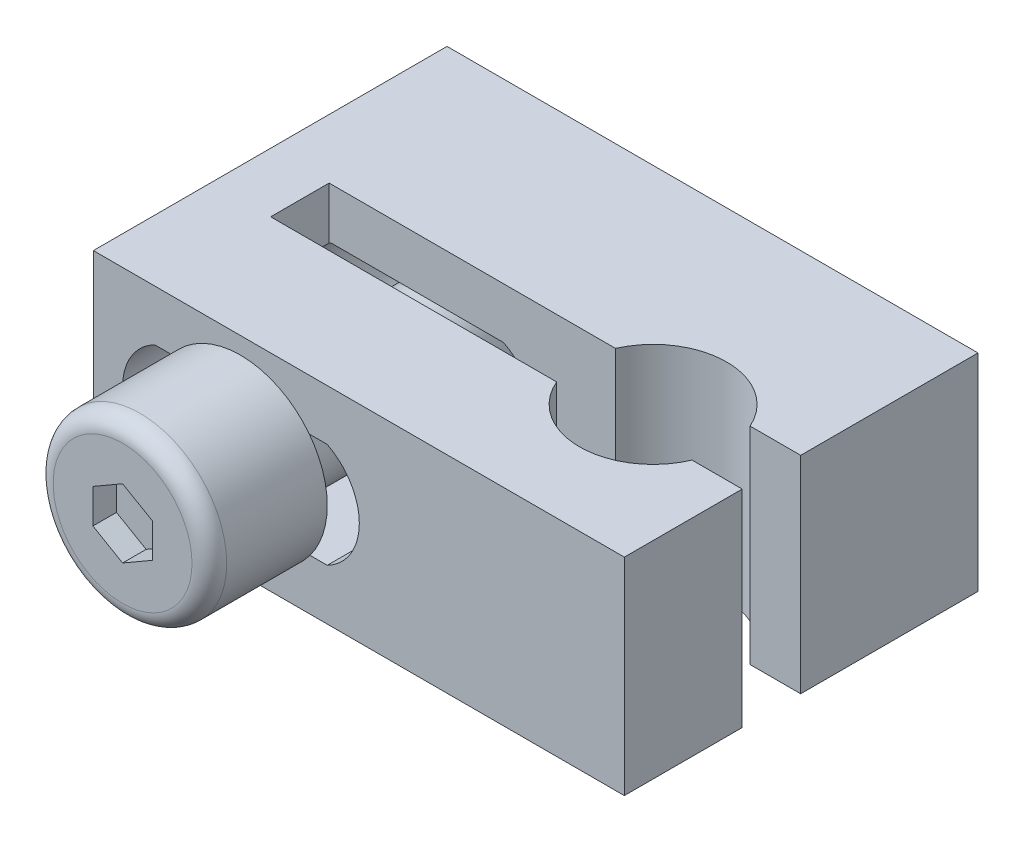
ISO-10303-21;
HEADER;
FILE_DESCRIPTION(('STEP AP214'),'2;1');
FILE_NAME('part.step','',(''),(''),'','','');
FILE_SCHEMA(('AUTOMOTIVE_DESIGN { 1 0 10303 214 1 1 1 1 }'));
ENDSEC;
DATA;
#1=APPLICATION_CONTEXT('core data for automotive mechanical design processes');
#2=APPLICATION_PROTOCOL_DEFINITION('international standard','automotive_design',2000,#1);
#3=PRODUCT_CONTEXT('',#1,'mechanical');
#4=PRODUCT('Part','Part','',(#3));
#5=PRODUCT_RELATED_PRODUCT_CATEGORY('part','',(#4));
#6=PRODUCT_DEFINITION_FORMATION('','',#4);
#7=PRODUCT_DEFINITION_CONTEXT('part definition',#1,'design');
#8=PRODUCT_DEFINITION('design','',#6,#7);
#9=PRODUCT_DEFINITION_SHAPE('','',#8);
#10=(LENGTH_UNIT() NAMED_UNIT(*) SI_UNIT(.MILLI.,.METRE.));
#11=(NAMED_UNIT(*) PLANE_ANGLE_UNIT() SI_UNIT($,.RADIAN.));
#12=(NAMED_UNIT(*) SI_UNIT($,.STERADIAN.) SOLID_ANGLE_UNIT());
#13=UNCERTAINTY_MEASURE_WITH_UNIT(LENGTH_MEASURE(1.E-05),#10,'distance_accuracy_value','');
#14=(GEOMETRIC_REPRESENTATION_CONTEXT(3) GLOBAL_UNCERTAINTY_ASSIGNED_CONTEXT((#13)) GLOBAL_UNIT_ASSIGNED_CONTEXT((#10,
#11,#12)) REPRESENTATION_CONTEXT('',''));
#15=CARTESIAN_POINT('',(0.,0.,0.));
#16=DIRECTION('',(0.,0.,1.));
#17=DIRECTION('',(1.,0.,0.));
#18=AXIS2_PLACEMENT_3D('',#15,#16,#17);
#19=CARTESIAN_POINT('',(-3.1877,-0.0127,7.9375));
#20=DIRECTION('',(0.,0.,-1.));
#21=DIRECTION('',(-1.,0.,0.));
#22=AXIS2_PLACEMENT_3D('',#19,#20,#21);
#23=PLANE('',#22);
#24=CARTESIAN_POINT('',(-3.1877,-0.0127,7.9375));
#25=DIRECTION('',(0.,0.,1.));
#26=DIRECTION('',(1.,0.,0.));
#27=AXIS2_PLACEMENT_3D('',#24,#25,#26);
#28=CIRCLE('',#27,1.86944);
#29=CARTESIAN_POINT('',(-1.31826,-0.0127,7.9375));
#30=VERTEX_POINT('',#29);
#31=EDGE_CURVE('E285',#30,#30,#28,.T.);
#32=ORIENTED_EDGE('',*,*,#31,.T.);
#33=EDGE_LOOP('',(#32));
#34=FACE_BOUND('',#33,.T.);
#35=DIRECTION('',(-0.866025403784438,-0.500000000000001,0.));
#36=VECTOR('',#35,1.);
#37=CARTESIAN_POINT('',(-3.58775,0.680206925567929,7.9375));
#38=LINE('',#37,#36);
#39=CARTESIAN_POINT('',(-3.1877,0.91117590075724,7.9375));
#40=VERTEX_POINT('',#39);
#41=CARTESIAN_POINT('',(-3.9878,0.44923795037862,7.9375));
#42=VERTEX_POINT('',#41);
#43=EDGE_CURVE('E11',#40,#42,#38,.T.);
#44=ORIENTED_EDGE('',*,*,#43,.F.);
#45=DIRECTION('',(-0.866025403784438,0.500000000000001,0.));
#46=VECTOR('',#45,1.);
#47=CARTESIAN_POINT('',(-2.78765,0.680206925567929,7.9375));
#48=LINE('',#47,#46);
#49=CARTESIAN_POINT('',(-2.3876,0.44923795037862,7.9375));
#50=VERTEX_POINT('',#49);
#51=EDGE_CURVE('E457',#50,#40,#48,.T.);
#52=ORIENTED_EDGE('',*,*,#51,.F.);
#53=DIRECTION('',(0.,1.,0.));
#54=VECTOR('',#53,1.);
#55=CARTESIAN_POINT('',(-2.3876,-0.0127,7.9375));
#56=LINE('',#55,#54);
#57=CARTESIAN_POINT('',(-2.3876,-0.47463795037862,7.9375));
#58=VERTEX_POINT('',#57);
#59=EDGE_CURVE('E459',#58,#50,#56,.T.);
#60=ORIENTED_EDGE('',*,*,#59,.F.);
#61=DIRECTION('',(0.866025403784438,0.5,0.));
#62=VECTOR('',#61,1.);
#63=CARTESIAN_POINT('',(-2.78765,-0.70560692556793,7.9375));
#64=LINE('',#63,#62);
#65=CARTESIAN_POINT('',(-3.1877,-0.93657590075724,7.9375));
#66=VERTEX_POINT('',#65);
#67=EDGE_CURVE('E461',#66,#58,#64,.T.);
#68=ORIENTED_EDGE('',*,*,#67,.F.);
#69=DIRECTION('',(0.866025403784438,-0.5,0.));
#70=VECTOR('',#69,1.);
#71=CARTESIAN_POINT('',(-3.58775,-0.70560692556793,7.9375));
#72=LINE('',#71,#70);
#73=CARTESIAN_POINT('',(-3.9878,-0.47463795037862,7.9375));
#74=VERTEX_POINT('',#73);
#75=EDGE_CURVE('E463',#74,#66,#72,.T.);
#76=ORIENTED_EDGE('',*,*,#75,.F.);
#77=DIRECTION('',(0.,-1.,0.));
#78=VECTOR('',#77,1.);
#79=CARTESIAN_POINT('',(-3.9878,-0.0127,7.9375));
#80=LINE('',#79,#78);
#81=EDGE_CURVE('E43',#42,#74,#80,.T.);
#82=ORIENTED_EDGE('',*,*,#81,.F.);
#83=EDGE_LOOP('',(#44,#52,#60,#68,#76,#82));
#84=FACE_BOUND('',#83,.T.);
#85=ADVANCED_FACE('F35',(#34,#84),#23,.F.);
#86=CARTESIAN_POINT('',(-7.1501,-2.7813,4.7625));
#87=DIRECTION('',(0.,0.,1.));
#88=DIRECTION('',(1.,0.,0.));
#89=AXIS2_PLACEMENT_3D('',#86,#87,#88);
#90=PLANE('',#89);
#91=DIRECTION('',(0.,-1.,0.));
#92=VECTOR('',#91,1.);
#93=CARTESIAN_POINT('',(-7.1501,2.7813,4.7625));
#94=LINE('',#93,#92);
#95=CARTESIAN_POINT('',(-7.1501,2.7813,4.7625));
#96=VERTEX_POINT('',#95);
#97=CARTESIAN_POINT('',(-7.1501,-2.7813,4.7625));
#98=VERTEX_POINT('',#97);
#99=EDGE_CURVE('E409',#96,#98,#94,.T.);
#100=ORIENTED_EDGE('',*,*,#99,.T.);
#101=DIRECTION('',(1.,0.,0.));
#102=VECTOR('',#101,1.);
#103=CARTESIAN_POINT('',(-7.1501,-2.7813,4.7625));
#104=LINE('',#103,#102);
#105=CARTESIAN_POINT('',(7.1501,-2.7813,4.7625));
#106=VERTEX_POINT('',#105);
#107=EDGE_CURVE('E412',#98,#106,#104,.T.);
#108=ORIENTED_EDGE('',*,*,#107,.T.);
#109=DIRECTION('',(0.,1.,0.));
#110=VECTOR('',#109,1.);
#111=CARTESIAN_POINT('',(7.1501,-2.7813,4.7625));
#112=LINE('',#111,#110);
#113=CARTESIAN_POINT('',(7.1501,2.7813,4.7625));
#114=VERTEX_POINT('',#113);
#115=EDGE_CURVE('E415',#106,#114,#112,.T.);
#116=ORIENTED_EDGE('',*,*,#115,.T.);
#117=DIRECTION('',(-1.,0.,0.));
#118=VECTOR('',#117,1.);
#119=CARTESIAN_POINT('',(7.1501,2.7813,4.7625));
#120=LINE('',#119,#118);
#121=EDGE_CURVE('E417',#114,#96,#120,.T.);
#122=ORIENTED_EDGE('',*,*,#121,.T.);
#123=EDGE_LOOP('',(#100,#108,#116,#122));
#124=FACE_BOUND('',#123,.T.);
#125=DIRECTION('',(1.,0.,0.));
#126=VECTOR('',#125,1.);
#127=CARTESIAN_POINT('',(-5.4991,-1.4097,4.7625));
#128=LINE('',#127,#126);
#129=CARTESIAN_POINT('',(-1.31446076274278,-1.4097,4.7625));
#130=VERTEX_POINT('',#129);
#131=CARTESIAN_POINT('',(-0.8509,-1.4097,4.7625));
#132=VERTEX_POINT('',#131);
#133=EDGE_CURVE('E367',#130,#132,#128,.T.);
#134=ORIENTED_EDGE('',*,*,#133,.F.);
#135=CARTESIAN_POINT('',(-3.1877,-0.0127,4.7625));
#136=DIRECTION('',(0.,0.,1.));
#137=DIRECTION('',(1.,0.,0.));
#138=AXIS2_PLACEMENT_3D('',#135,#136,#137);
#139=CIRCLE('',#138,2.3368);
#140=CARTESIAN_POINT('',(-5.06093923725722,-1.4097,4.7625));
#141=VERTEX_POINT('',#140);
#142=EDGE_CURVE('E454',#130,#141,#139,.F.);
#143=ORIENTED_EDGE('',*,*,#142,.T.);
#144=CARTESIAN_POINT('',(-5.4991,-1.4097,4.7625));
#145=VERTEX_POINT('',#144);
#146=EDGE_CURVE('E369',#145,#141,#128,.T.);
#147=ORIENTED_EDGE('',*,*,#146,.F.);
#148=CARTESIAN_POINT('',(-4.78033602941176,0.,4.7625));
#149=DIRECTION('',(0.,0.,1.));
#150=DIRECTION('',(1.,0.,0.));
#151=AXIS2_PLACEMENT_3D('',#148,#149,#150);
#152=CIRCLE('',#151,1.58236397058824);
#153=CARTESIAN_POINT('',(-5.4991,1.4097,4.7625));
#154=VERTEX_POINT('',#153);
#155=EDGE_CURVE('E365',#154,#145,#152,.T.);
#156=ORIENTED_EDGE('',*,*,#155,.F.);
#157=DIRECTION('',(-1.,0.,0.));
#158=VECTOR('',#157,1.);
#159=CARTESIAN_POINT('',(-0.8509,1.4097,4.7625));
#160=LINE('',#159,#158);
#161=CARTESIAN_POINT('',(-5.0417260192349,1.4097,4.7625));
#162=VERTEX_POINT('',#161);
#163=EDGE_CURVE('E376',#162,#154,#160,.T.);
#164=ORIENTED_EDGE('',*,*,#163,.F.);
#165=CARTESIAN_POINT('',(-3.1877,-0.0127,4.7625));
#166=DIRECTION('',(0.,0.,1.));
#167=DIRECTION('',(1.,0.,0.));
#168=AXIS2_PLACEMENT_3D('',#165,#166,#167);
#169=CIRCLE('',#168,2.3368);
#170=CARTESIAN_POINT('',(-1.3336739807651,1.4097,4.7625));
#171=VERTEX_POINT('',#170);
#172=EDGE_CURVE('E279',#171,#162,#169,.T.);
#173=ORIENTED_EDGE('',*,*,#172,.F.);
#174=CARTESIAN_POINT('',(-0.8509,1.4097,4.7625));
#175=VERTEX_POINT('',#174);
#176=EDGE_CURVE('E377',#175,#171,#160,.T.);
#177=ORIENTED_EDGE('',*,*,#176,.F.);
#178=CARTESIAN_POINT('',(-1.56966397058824,0.,4.7625));
#179=DIRECTION('',(0.,0.,1.));
#180=DIRECTION('',(1.,0.,0.));
#181=AXIS2_PLACEMENT_3D('',#178,#179,#180);
#182=CIRCLE('',#181,1.58236397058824);
#183=EDGE_CURVE('E372',#132,#175,#182,.T.);
#184=ORIENTED_EDGE('',*,*,#183,.F.);
#185=EDGE_LOOP('',(#134,#143,#147,#156,#164,#173,#177,#184));
#186=FACE_BOUND('',#185,.T.);
#187=ADVANCED_FACE('F489',(#124,#186),#90,.T.);
#188=CARTESIAN_POINT('',(-7.1501,-2.7813,4.7625));
#189=DIRECTION('',(0.,1.,0.));
#190=DIRECTION('',(0.,0.,1.));
#191=AXIS2_PLACEMENT_3D('',#188,#189,#190);
#192=PLANE('',#191);
#193=DIRECTION('',(1.,0.,0.));
#194=VECTOR('',#193,1.);
#195=CARTESIAN_POINT('',(5.7985564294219,-2.7813,1.5875));
#196=LINE('',#195,#194);
#197=CARTESIAN_POINT('',(5.7985564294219,-2.7813,1.5875));
#198=VERTEX_POINT('',#197);
#199=CARTESIAN_POINT('',(7.1501,-2.7813,1.5875));
#200=VERTEX_POINT('',#199);
#201=EDGE_CURVE('E317',#198,#200,#196,.T.);
#202=ORIENTED_EDGE('',*,*,#201,.T.);
#203=DIRECTION('',(0.,0.,-1.));
#204=VECTOR('',#203,1.);
#205=CARTESIAN_POINT('',(7.1501,-2.7813,4.7625));
#206=LINE('',#205,#204);
#207=EDGE_CURVE('E436',#106,#200,#206,.T.);
#208=ORIENTED_EDGE('',*,*,#207,.F.);
#209=ORIENTED_EDGE('',*,*,#107,.F.);
#210=DIRECTION('',(0.,0.,-1.));
#211=VECTOR('',#210,1.);
#212=CARTESIAN_POINT('',(-7.1501,-2.7813,4.7625));
#213=LINE('',#212,#211);
#214=CARTESIAN_POINT('',(-7.1501,-2.7813,-4.7625));
#215=VERTEX_POINT('',#214);
#216=EDGE_CURVE('E439',#98,#215,#213,.T.);
#217=ORIENTED_EDGE('',*,*,#216,.T.);
#218=DIRECTION('',(1.,0.,0.));
#219=VECTOR('',#218,1.);
#220=CARTESIAN_POINT('',(-7.1501,-2.7813,-4.7625));
#221=LINE('',#220,#219);
#222=CARTESIAN_POINT('',(7.1501,-2.7813,-4.7625));
#223=VERTEX_POINT('',#222);
#224=EDGE_CURVE('E422',#215,#223,#221,.T.);
#225=ORIENTED_EDGE('',*,*,#224,.T.);
#226=CARTESIAN_POINT('',(7.1501,-2.7813,0.0127));
#227=VERTEX_POINT('',#226);
#228=EDGE_CURVE('E435',#227,#223,#206,.T.);
#229=ORIENTED_EDGE('',*,*,#228,.F.);
#230=DIRECTION('',(-1.,0.,0.));
#231=VECTOR('',#230,1.);
#232=CARTESIAN_POINT('',(7.1501,-2.7813,0.0127));
#233=LINE('',#232,#231);
#234=CARTESIAN_POINT('',(5.7875550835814,-2.7813,0.0127));
#235=VERTEX_POINT('',#234);
#236=EDGE_CURVE('E320',#227,#235,#233,.T.);
#237=ORIENTED_EDGE('',*,*,#236,.T.);
#238=CARTESIAN_POINT('',(3.9751,-2.7813,0.812799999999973));
#239=DIRECTION('',(0.,1.,0.));
#240=DIRECTION('',(0.,0.,1.));
#241=AXIS2_PLACEMENT_3D('',#238,#239,#240);
#242=CIRCLE('',#241,1.9812);
#243=CARTESIAN_POINT('',(2.1626449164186,-2.7813,0.0126999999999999));
#244=VERTEX_POINT('',#243);
#245=EDGE_CURVE('E292',#235,#244,#242,.T.);
#246=ORIENTED_EDGE('',*,*,#245,.T.);
#247=DIRECTION('',(-1.,0.,0.));
#248=VECTOR('',#247,1.);
#249=CARTESIAN_POINT('',(2.1626449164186,-2.7813,0.0127));
#250=LINE('',#249,#248);
#251=CARTESIAN_POINT('',(-5.5499,-2.7813,0.0127));
#252=VERTEX_POINT('',#251);
#253=EDGE_CURVE('E288',#244,#252,#250,.T.);
#254=ORIENTED_EDGE('',*,*,#253,.T.);
#255=DIRECTION('',(0.,0.,1.));
#256=VECTOR('',#255,1.);
#257=CARTESIAN_POINT('',(-5.5499,-2.7813,0.0127));
#258=LINE('',#257,#256);
#259=CARTESIAN_POINT('',(-5.5499,-2.7813,1.5875));
#260=VERTEX_POINT('',#259);
#261=EDGE_CURVE('E308',#252,#260,#258,.T.);
#262=ORIENTED_EDGE('',*,*,#261,.T.);
#263=DIRECTION('',(1.,0.,0.));
#264=VECTOR('',#263,1.);
#265=CARTESIAN_POINT('',(-5.5499,-2.7813,1.5875));
#266=LINE('',#265,#264);
#267=CARTESIAN_POINT('',(2.1516435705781,-2.7813,1.5875));
#268=VERTEX_POINT('',#267);
#269=EDGE_CURVE('E311',#260,#268,#266,.T.);
#270=ORIENTED_EDGE('',*,*,#269,.T.);
#271=CARTESIAN_POINT('',(3.9751,-2.7813,0.812799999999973));
#272=DIRECTION('',(0.,1.,0.));
#273=DIRECTION('',(0.,0.,1.));
#274=AXIS2_PLACEMENT_3D('',#271,#272,#273);
#275=CIRCLE('',#274,1.98120000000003);
#276=EDGE_CURVE('E314',#268,#198,#275,.T.);
#277=ORIENTED_EDGE('',*,*,#276,.T.);
#278=EDGE_LOOP('',(#202,#208,#209,#217,#225,#229,#237,#246,#254,#262,#270,#277));
#279=FACE_BOUND('',#278,.T.);
#280=ADVANCED_FACE('F495',(#279),#192,.F.);
#281=CARTESIAN_POINT('',(7.1501,-2.7813,4.7625));
#282=DIRECTION('',(-1.,0.,0.));
#283=DIRECTION('',(0.,0.,1.));
#284=AXIS2_PLACEMENT_3D('',#281,#282,#283);
#285=PLANE('',#284);
#286=DIRECTION('',(0.,-1.,0.));
#287=VECTOR('',#286,1.);
#288=CARTESIAN_POINT('',(7.1501,2.7813,1.5875));
#289=LINE('',#288,#287);
#290=CARTESIAN_POINT('',(7.1501,2.7813,1.5875));
#291=VERTEX_POINT('',#290);
#292=EDGE_CURVE('E331',#291,#200,#289,.T.);
#293=ORIENTED_EDGE('',*,*,#292,.F.);
#294=DIRECTION('',(0.,0.,-1.));
#295=VECTOR('',#294,1.);
#296=CARTESIAN_POINT('',(7.1501,2.7813,4.7625));
#297=LINE('',#296,#295);
#298=EDGE_CURVE('E432',#114,#291,#297,.T.);
#299=ORIENTED_EDGE('',*,*,#298,.F.);
#300=ORIENTED_EDGE('',*,*,#115,.F.);
#301=ORIENTED_EDGE('',*,*,#207,.T.);
#302=EDGE_LOOP('',(#293,#299,#300,#301));
#303=FACE_BOUND('',#302,.T.);
#304=ADVANCED_FACE('F559',(#303),#285,.F.);
#305=DIRECTION('',(0.,-1.,0.));
#306=VECTOR('',#305,1.);
#307=CARTESIAN_POINT('',(7.1501,2.7813,0.0127));
#308=LINE('',#307,#306);
#309=CARTESIAN_POINT('',(7.1501,2.7813,0.0127));
#310=VERTEX_POINT('',#309);
#311=EDGE_CURVE('E328',#310,#227,#308,.T.);
#312=ORIENTED_EDGE('',*,*,#311,.T.);
#313=ORIENTED_EDGE('',*,*,#228,.T.);
#314=DIRECTION('',(0.,1.,0.));
#315=VECTOR('',#314,1.);
#316=CARTESIAN_POINT('',(7.1501,-2.7813,-4.7625));
#317=LINE('',#316,#315);
#318=CARTESIAN_POINT('',(7.1501,2.7813,-4.7625));
#319=VERTEX_POINT('',#318);
#320=EDGE_CURVE('E425',#223,#319,#317,.T.);
#321=ORIENTED_EDGE('',*,*,#320,.T.);
#322=EDGE_CURVE('E431',#310,#319,#297,.T.);
#323=ORIENTED_EDGE('',*,*,#322,.F.);
#324=EDGE_LOOP('',(#312,#313,#321,#323));
#325=FACE_BOUND('',#324,.T.);
#326=ADVANCED_FACE('F557',(#325),#285,.F.);
#327=CARTESIAN_POINT('',(7.1501,2.7813,4.7625));
#328=DIRECTION('',(0.,-1.,0.));
#329=DIRECTION('',(0.,0.,-1.));
#330=AXIS2_PLACEMENT_3D('',#327,#328,#329);
#331=PLANE('',#330);
#332=DIRECTION('',(1.,0.,0.));
#333=VECTOR('',#332,1.);
#334=CARTESIAN_POINT('',(5.7985564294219,2.7813,1.5875));
#335=LINE('',#334,#333);
#336=CARTESIAN_POINT('',(5.7985564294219,2.7813,1.5875));
#337=VERTEX_POINT('',#336);
#338=EDGE_CURVE('E298',#337,#291,#335,.T.);
#339=ORIENTED_EDGE('',*,*,#338,.F.);
#340=CARTESIAN_POINT('',(3.9751,2.7813,0.812799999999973));
#341=DIRECTION('',(0.,1.,0.));
#342=DIRECTION('',(0.,0.,1.));
#343=AXIS2_PLACEMENT_3D('',#340,#341,#342);
#344=CIRCLE('',#343,1.98120000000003);
#345=CARTESIAN_POINT('',(2.1516435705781,2.7813,1.5875));
#346=VERTEX_POINT('',#345);
#347=EDGE_CURVE('E296',#346,#337,#344,.T.);
#348=ORIENTED_EDGE('',*,*,#347,.F.);
#349=DIRECTION('',(1.,0.,0.));
#350=VECTOR('',#349,1.);
#351=CARTESIAN_POINT('',(-5.5499,2.7813,1.5875));
#352=LINE('',#351,#350);
#353=CARTESIAN_POINT('',(-5.5499,2.7813,1.5875));
#354=VERTEX_POINT('',#353);
#355=EDGE_CURVE('E294',#354,#346,#352,.T.);
#356=ORIENTED_EDGE('',*,*,#355,.F.);
#357=DIRECTION('',(0.,0.,1.));
#358=VECTOR('',#357,1.);
#359=CARTESIAN_POINT('',(-5.5499,2.7813,0.0127));
#360=LINE('',#359,#358);
#361=CARTESIAN_POINT('',(-5.5499,2.7813,0.0127));
#362=VERTEX_POINT('',#361);
#363=EDGE_CURVE('E291',#362,#354,#360,.T.);
#364=ORIENTED_EDGE('',*,*,#363,.F.);
#365=DIRECTION('',(-1.,0.,0.));
#366=VECTOR('',#365,1.);
#367=CARTESIAN_POINT('',(2.1626449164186,2.7813,0.0127));
#368=LINE('',#367,#366);
#369=CARTESIAN_POINT('',(2.1626449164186,2.7813,0.0126999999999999));
#370=VERTEX_POINT('',#369);
#371=EDGE_CURVE('E289',#370,#362,#368,.T.);
#372=ORIENTED_EDGE('',*,*,#371,.F.);
#373=CARTESIAN_POINT('',(3.9751,2.7813,0.812799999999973));
#374=DIRECTION('',(0.,1.,0.));
#375=DIRECTION('',(0.,0.,1.));
#376=AXIS2_PLACEMENT_3D('',#373,#374,#375);
#377=CIRCLE('',#376,1.9812);
#378=CARTESIAN_POINT('',(5.7875550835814,2.7813,0.0127000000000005));
#379=VERTEX_POINT('',#378);
#380=EDGE_CURVE('E303',#379,#370,#377,.T.);
#381=ORIENTED_EDGE('',*,*,#380,.F.);
#382=DIRECTION('',(-1.,0.,0.));
#383=VECTOR('',#382,1.);
#384=CARTESIAN_POINT('',(7.1501,2.7813,0.0127));
#385=LINE('',#384,#383);
#386=EDGE_CURVE('E300',#310,#379,#385,.T.);
#387=ORIENTED_EDGE('',*,*,#386,.F.);
#388=ORIENTED_EDGE('',*,*,#322,.T.);
#389=DIRECTION('',(-1.,0.,0.));
#390=VECTOR('',#389,1.);
#391=CARTESIAN_POINT('',(7.1501,2.7813,-4.7625));
#392=LINE('',#391,#390);
#393=CARTESIAN_POINT('',(-7.1501,2.7813,-4.7625));
#394=VERTEX_POINT('',#393);
#395=EDGE_CURVE('E413',#319,#394,#392,.T.);
#396=ORIENTED_EDGE('',*,*,#395,.T.);
#397=DIRECTION('',(0.,0.,-1.));
#398=VECTOR('',#397,1.);
#399=CARTESIAN_POINT('',(-7.1501,2.7813,4.7625));
#400=LINE('',#399,#398);
#401=EDGE_CURVE('E419',#96,#394,#400,.T.);
#402=ORIENTED_EDGE('',*,*,#401,.F.);
#403=ORIENTED_EDGE('',*,*,#121,.F.);
#404=ORIENTED_EDGE('',*,*,#298,.T.);
#405=EDGE_LOOP('',(#339,#348,#356,#364,#372,#381,#387,#388,#396,#402,#403,#404));
#406=FACE_BOUND('',#405,.T.);
#407=ADVANCED_FACE('F548',(#406),#331,.F.);
#408=CARTESIAN_POINT('',(-4.78033602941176,0.,4.7625));
#409=DIRECTION('',(0.,0.,-1.));
#410=DIRECTION('',(-1.,0.,0.));
#411=AXIS2_PLACEMENT_3D('',#408,#409,#410);
#412=CYLINDRICAL_SURFACE('',#411,1.58236397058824);
#413=DIRECTION('',(0.,0.,-1.));
#414=VECTOR('',#413,1.);
#415=CARTESIAN_POINT('',(-5.4991,1.4097,4.7625));
#416=LINE('',#415,#414);
#417=CARTESIAN_POINT('',(-5.4991,1.4097,0.0127));
#418=VERTEX_POINT('',#417);
#419=CARTESIAN_POINT('',(-5.4991,1.4097,-4.7625));
#420=VERTEX_POINT('',#419);
#421=EDGE_CURVE('E380',#418,#420,#416,.T.);
#422=ORIENTED_EDGE('',*,*,#421,.F.);
#423=CARTESIAN_POINT('',(-4.78033602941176,0.,0.0127000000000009));
#424=DIRECTION('',(0.,0.,1.));
#425=DIRECTION('',(1.,0.,0.));
#426=AXIS2_PLACEMENT_3D('',#423,#424,#425);
#427=CIRCLE('',#426,1.58236397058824);
#428=CARTESIAN_POINT('',(-5.5499,1.38262324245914,0.0127));
#429=VERTEX_POINT('',#428);
#430=EDGE_CURVE('E361',#418,#429,#427,.T.);
#431=ORIENTED_EDGE('',*,*,#430,.T.);
#432=DIRECTION('',(0.,0.,-1.));
#433=VECTOR('',#432,1.);
#434=CARTESIAN_POINT('',(-5.5499,1.38262324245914,4.7625));
#435=LINE('',#434,#433);
#436=CARTESIAN_POINT('',(-5.5499,1.38262324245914,1.5875));
#437=VERTEX_POINT('',#436);
#438=EDGE_CURVE('E451',#429,#437,#435,.F.);
#439=ORIENTED_EDGE('',*,*,#438,.T.);
#440=CARTESIAN_POINT('',(-4.78033602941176,0.,1.5875));
#441=DIRECTION('',(0.,0.,-1.));
#442=DIRECTION('',(-1.,0.,0.));
#443=AXIS2_PLACEMENT_3D('',#440,#441,#442);
#444=CIRCLE('',#443,1.58236397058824);
#445=CARTESIAN_POINT('',(-5.4991,1.4097,1.5875));
#446=VERTEX_POINT('',#445);
#447=EDGE_CURVE('E354',#437,#446,#444,.T.);
#448=ORIENTED_EDGE('',*,*,#447,.T.);
#449=EDGE_CURVE('E393',#154,#446,#416,.T.);
#450=ORIENTED_EDGE('',*,*,#449,.F.);
#451=ORIENTED_EDGE('',*,*,#155,.T.);
#452=DIRECTION('',(0.,0.,-1.));
#453=VECTOR('',#452,1.);
#454=CARTESIAN_POINT('',(-5.4991,-1.4097,4.7625));
#455=LINE('',#454,#453);
#456=CARTESIAN_POINT('',(-5.4991,-1.4097,1.5875));
#457=VERTEX_POINT('',#456);
#458=EDGE_CURVE('E405',#145,#457,#455,.T.);
#459=ORIENTED_EDGE('',*,*,#458,.T.);
#460=CARTESIAN_POINT('',(-5.5499,-1.38262324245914,1.5875));
#461=VERTEX_POINT('',#460);
#462=EDGE_CURVE('E351',#457,#461,#444,.T.);
#463=ORIENTED_EDGE('',*,*,#462,.T.);
#464=DIRECTION('',(0.,0.,-1.));
#465=VECTOR('',#464,1.);
#466=CARTESIAN_POINT('',(-5.5499,-1.38262324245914,4.7625));
#467=LINE('',#466,#465);
#468=CARTESIAN_POINT('',(-5.5499,-1.38262324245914,0.0127));
#469=VERTEX_POINT('',#468);
#470=EDGE_CURVE('E448',#461,#469,#467,.T.);
#471=ORIENTED_EDGE('',*,*,#470,.T.);
#472=CARTESIAN_POINT('',(-5.4991,-1.4097,0.0127));
#473=VERTEX_POINT('',#472);
#474=EDGE_CURVE('E364',#469,#473,#427,.T.);
#475=ORIENTED_EDGE('',*,*,#474,.T.);
#476=CARTESIAN_POINT('',(-5.4991,-1.4097,-4.7625));
#477=VERTEX_POINT('',#476);
#478=EDGE_CURVE('E404',#473,#477,#455,.T.);
#479=ORIENTED_EDGE('',*,*,#478,.T.);
#480=CARTESIAN_POINT('',(-4.78033602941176,0.,-4.7625));
#481=DIRECTION('',(0.,0.,1.));
#482=DIRECTION('',(1.,0.,0.));
#483=AXIS2_PLACEMENT_3D('',#480,#481,#482);
#484=CIRCLE('',#483,1.58236397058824);
#485=EDGE_CURVE('E382',#420,#477,#484,.T.);
#486=ORIENTED_EDGE('',*,*,#485,.F.);
#487=EDGE_LOOP('',(#422,#431,#439,#448,#450,#451,#459,#463,#471,#475,#479,#486));
#488=FACE_BOUND('',#487,.T.);
#489=ADVANCED_FACE('F545',(#488),#412,.F.);
#490=CARTESIAN_POINT('',(-5.4991,-1.4097,4.7625));
#491=DIRECTION('',(0.,1.,0.));
#492=DIRECTION('',(0.,0.,1.));
#493=AXIS2_PLACEMENT_3D('',#490,#491,#492);
#494=PLANE('',#493);
#495=ORIENTED_EDGE('',*,*,#478,.F.);
#496=DIRECTION('',(1.,0.,0.));
#497=VECTOR('',#496,1.);
#498=CARTESIAN_POINT('',(-5.4991,-1.4097,0.0127));
#499=LINE('',#498,#497);
#500=CARTESIAN_POINT('',(-0.8509,-1.4097,0.0127000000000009));
#501=VERTEX_POINT('',#500);
#502=EDGE_CURVE('E358',#473,#501,#499,.T.);
#503=ORIENTED_EDGE('',*,*,#502,.T.);
#504=DIRECTION('',(0.,0.,-1.));
#505=VECTOR('',#504,1.);
#506=CARTESIAN_POINT('',(-0.8509,-1.4097,4.7625));
#507=LINE('',#506,#505);
#508=CARTESIAN_POINT('',(-0.8509,-1.4097,-4.7625));
#509=VERTEX_POINT('',#508);
#510=EDGE_CURVE('E400',#501,#509,#507,.T.);
#511=ORIENTED_EDGE('',*,*,#510,.T.);
#512=DIRECTION('',(1.,0.,0.));
#513=VECTOR('',#512,1.);
#514=CARTESIAN_POINT('',(-5.4991,-1.4097,-4.7625));
#515=LINE('',#514,#513);
#516=EDGE_CURVE('E385',#477,#509,#515,.T.);
#517=ORIENTED_EDGE('',*,*,#516,.F.);
#518=EDGE_LOOP('',(#495,#503,#511,#517));
#519=FACE_BOUND('',#518,.T.);
#520=ADVANCED_FACE('F542',(#519),#494,.T.);
#521=CARTESIAN_POINT('',(-0.8509,-1.4097,1.5875));
#522=VERTEX_POINT('',#521);
#523=EDGE_CURVE('E401',#132,#522,#507,.T.);
#524=ORIENTED_EDGE('',*,*,#523,.T.);
#525=DIRECTION('',(-1.,0.,0.));
#526=VECTOR('',#525,1.);
#527=CARTESIAN_POINT('',(-5.4991,-1.4097,1.5875));
#528=LINE('',#527,#526);
#529=EDGE_CURVE('E348',#522,#457,#528,.T.);
#530=ORIENTED_EDGE('',*,*,#529,.T.);
#531=ORIENTED_EDGE('',*,*,#458,.F.);
#532=ORIENTED_EDGE('',*,*,#146,.T.);
#533=EDGE_CURVE('E373',#141,#130,#128,.T.);
#534=ORIENTED_EDGE('',*,*,#533,.T.);
#535=ORIENTED_EDGE('',*,*,#133,.T.);
#536=EDGE_LOOP('',(#524,#530,#531,#532,#534,#535));
#537=FACE_BOUND('',#536,.T.);
#538=ADVANCED_FACE('F540',(#537),#494,.T.);
#539=CARTESIAN_POINT('',(-1.56966397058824,0.,4.7625));
#540=DIRECTION('',(0.,0.,-1.));
#541=DIRECTION('',(-1.,0.,0.));
#542=AXIS2_PLACEMENT_3D('',#539,#540,#541);
#543=CYLINDRICAL_SURFACE('',#542,1.58236397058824);
#544=ORIENTED_EDGE('',*,*,#510,.F.);
#545=CARTESIAN_POINT('',(-1.56966397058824,0.,0.0127000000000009));
#546=DIRECTION('',(0.,0.,1.));
#547=DIRECTION('',(1.,0.,0.));
#548=AXIS2_PLACEMENT_3D('',#545,#546,#547);
#549=CIRCLE('',#548,1.58236397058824);
#550=CARTESIAN_POINT('',(-0.8509,1.4097,0.0127));
#551=VERTEX_POINT('',#550);
#552=EDGE_CURVE('E355',#501,#551,#549,.T.);
#553=ORIENTED_EDGE('',*,*,#552,.T.);
#554=DIRECTION('',(0.,0.,-1.));
#555=VECTOR('',#554,1.);
#556=CARTESIAN_POINT('',(-0.8509,1.4097,4.7625));
#557=LINE('',#556,#555);
#558=CARTESIAN_POINT('',(-0.8509,1.4097,-4.7625));
#559=VERTEX_POINT('',#558);
#560=EDGE_CURVE('E396',#551,#559,#557,.T.);
#561=ORIENTED_EDGE('',*,*,#560,.T.);
#562=CARTESIAN_POINT('',(-1.56966397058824,0.,-4.7625));
#563=DIRECTION('',(0.,0.,1.));
#564=DIRECTION('',(1.,0.,0.));
#565=AXIS2_PLACEMENT_3D('',#562,#563,#564);
#566=CIRCLE('',#565,1.58236397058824);
#567=EDGE_CURVE('E388',#509,#559,#566,.T.);
#568=ORIENTED_EDGE('',*,*,#567,.F.);
#569=EDGE_LOOP('',(#544,#553,#561,#568));
#570=FACE_BOUND('',#569,.T.);
#571=ADVANCED_FACE('F537',(#570),#543,.F.);
#572=CARTESIAN_POINT('',(-0.8509,1.4097,1.5875));
#573=VERTEX_POINT('',#572);
#574=EDGE_CURVE('E397',#175,#573,#557,.T.);
#575=ORIENTED_EDGE('',*,*,#574,.T.);
#576=CARTESIAN_POINT('',(-1.56966397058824,0.,1.5875));
#577=DIRECTION('',(0.,0.,-1.));
#578=DIRECTION('',(-1.,0.,0.));
#579=AXIS2_PLACEMENT_3D('',#576,#577,#578);
#580=CIRCLE('',#579,1.58236397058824);
#581=EDGE_CURVE('E345',#573,#522,#580,.T.);
#582=ORIENTED_EDGE('',*,*,#581,.T.);
#583=ORIENTED_EDGE('',*,*,#523,.F.);
#584=ORIENTED_EDGE('',*,*,#183,.T.);
#585=EDGE_LOOP('',(#575,#582,#583,#584));
#586=FACE_BOUND('',#585,.T.);
#587=ADVANCED_FACE('F535',(#586),#543,.F.);
#588=CARTESIAN_POINT('',(-0.8509,1.4097,4.7625));
#589=DIRECTION('',(0.,-1.,0.));
#590=DIRECTION('',(0.,0.,-1.));
#591=AXIS2_PLACEMENT_3D('',#588,#589,#590);
#592=PLANE('',#591);
#593=ORIENTED_EDGE('',*,*,#560,.F.);
#594=DIRECTION('',(-1.,0.,0.));
#595=VECTOR('',#594,1.);
#596=CARTESIAN_POINT('',(-0.8509,1.4097,0.0127));
#597=LINE('',#596,#595);
#598=EDGE_CURVE('E445',#551,#418,#597,.T.);
#599=ORIENTED_EDGE('',*,*,#598,.T.);
#600=ORIENTED_EDGE('',*,*,#421,.T.);
#601=DIRECTION('',(-1.,0.,0.));
#602=VECTOR('',#601,1.);
#603=CARTESIAN_POINT('',(-0.8509,1.4097,-4.7625));
#604=LINE('',#603,#602);
#605=EDGE_CURVE('E368',#559,#420,#604,.T.);
#606=ORIENTED_EDGE('',*,*,#605,.F.);
#607=EDGE_LOOP('',(#593,#599,#600,#606));
#608=FACE_BOUND('',#607,.T.);
#609=ADVANCED_FACE('F531',(#608),#592,.T.);
#610=ORIENTED_EDGE('',*,*,#449,.T.);
#611=DIRECTION('',(1.,0.,0.));
#612=VECTOR('',#611,1.);
#613=CARTESIAN_POINT('',(-0.8509,1.4097,1.5875));
#614=LINE('',#613,#612);
#615=EDGE_CURVE('E442',#446,#573,#614,.T.);
#616=ORIENTED_EDGE('',*,*,#615,.T.);
#617=ORIENTED_EDGE('',*,*,#574,.F.);
#618=ORIENTED_EDGE('',*,*,#176,.T.);
#619=EDGE_CURVE('E381',#171,#162,#160,.T.);
#620=ORIENTED_EDGE('',*,*,#619,.T.);
#621=ORIENTED_EDGE('',*,*,#163,.T.);
#622=EDGE_LOOP('',(#610,#616,#617,#618,#620,#621));
#623=FACE_BOUND('',#622,.T.);
#624=ADVANCED_FACE('F534',(#623),#592,.T.);
#625=CARTESIAN_POINT('',(-7.1501,-2.7813,-4.7625));
#626=DIRECTION('',(0.,0.,1.));
#627=DIRECTION('',(1.,0.,0.));
#628=AXIS2_PLACEMENT_3D('',#625,#626,#627);
#629=PLANE('',#628);
#630=DIRECTION('',(0.,-1.,0.));
#631=VECTOR('',#630,1.);
#632=CARTESIAN_POINT('',(-7.1501,2.7813,-4.7625));
#633=LINE('',#632,#631);
#634=EDGE_CURVE('E408',#394,#215,#633,.T.);
#635=ORIENTED_EDGE('',*,*,#634,.F.);
#636=ORIENTED_EDGE('',*,*,#395,.F.);
#637=ORIENTED_EDGE('',*,*,#320,.F.);
#638=ORIENTED_EDGE('',*,*,#224,.F.);
#639=EDGE_LOOP('',(#635,#636,#637,#638));
#640=FACE_BOUND('',#639,.T.);
#641=ORIENTED_EDGE('',*,*,#485,.T.);
#642=ORIENTED_EDGE('',*,*,#516,.T.);
#643=ORIENTED_EDGE('',*,*,#567,.T.);
#644=ORIENTED_EDGE('',*,*,#605,.T.);
#645=EDGE_LOOP('',(#641,#642,#643,#644));
#646=FACE_BOUND('',#645,.T.);
#647=ADVANCED_FACE('F551',(#640,#646),#629,.F.);
#648=CARTESIAN_POINT('',(-7.1501,2.7813,4.7625));
#649=DIRECTION('',(1.,0.,0.));
#650=DIRECTION('',(0.,0.,-1.));
#651=AXIS2_PLACEMENT_3D('',#648,#649,#650);
#652=PLANE('',#651);
#653=ORIENTED_EDGE('',*,*,#634,.T.);
#654=ORIENTED_EDGE('',*,*,#216,.F.);
#655=ORIENTED_EDGE('',*,*,#99,.F.);
#656=ORIENTED_EDGE('',*,*,#401,.T.);
#657=EDGE_LOOP('',(#653,#654,#655,#656));
#658=FACE_BOUND('',#657,.T.);
#659=ADVANCED_FACE('F37',(#658),#652,.F.);
#660=CARTESIAN_POINT('',(-5.5499,2.7813,0.0127));
#661=DIRECTION('',(1.,0.,0.));
#662=DIRECTION('',(0.,0.,-1.));
#663=AXIS2_PLACEMENT_3D('',#660,#661,#662);
#664=PLANE('',#663);
#665=DIRECTION('',(0.,-1.,0.));
#666=VECTOR('',#665,1.);
#667=CARTESIAN_POINT('',(-5.5499,2.7813,1.5875));
#668=LINE('',#667,#666);
#669=EDGE_CURVE('E337',#461,#260,#668,.T.);
#670=ORIENTED_EDGE('',*,*,#669,.T.);
#671=ORIENTED_EDGE('',*,*,#261,.F.);
#672=DIRECTION('',(0.,-1.,0.));
#673=VECTOR('',#672,1.);
#674=CARTESIAN_POINT('',(-5.5499,2.7813,0.0127));
#675=LINE('',#674,#673);
#676=EDGE_CURVE('E341',#469,#252,#675,.T.);
#677=ORIENTED_EDGE('',*,*,#676,.F.);
#678=ORIENTED_EDGE('',*,*,#470,.F.);
#679=EDGE_LOOP('',(#670,#671,#677,#678));
#680=FACE_BOUND('',#679,.T.);
#681=ADVANCED_FACE('F527',(#680),#664,.T.);
#682=CARTESIAN_POINT('',(2.1626449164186,2.7813,0.0127));
#683=DIRECTION('',(0.,0.,1.));
#684=DIRECTION('',(1.,0.,0.));
#685=AXIS2_PLACEMENT_3D('',#682,#683,#684);
#686=PLANE('',#685);
#687=ORIENTED_EDGE('',*,*,#676,.T.);
#688=ORIENTED_EDGE('',*,*,#253,.F.);
#689=DIRECTION('',(0.,-1.,0.));
#690=VECTOR('',#689,1.);
#691=CARTESIAN_POINT('',(2.1626449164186,2.7813,0.0126999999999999));
#692=LINE('',#691,#690);
#693=EDGE_CURVE('E305',#370,#244,#692,.T.);
#694=ORIENTED_EDGE('',*,*,#693,.F.);
#695=ORIENTED_EDGE('',*,*,#371,.T.);
#696=EDGE_CURVE('E342',#362,#429,#675,.T.);
#697=ORIENTED_EDGE('',*,*,#696,.T.);
#698=ORIENTED_EDGE('',*,*,#430,.F.);
#699=ORIENTED_EDGE('',*,*,#598,.F.);
#700=ORIENTED_EDGE('',*,*,#552,.F.);
#701=ORIENTED_EDGE('',*,*,#502,.F.);
#702=ORIENTED_EDGE('',*,*,#474,.F.);
#703=EDGE_LOOP('',(#687,#688,#694,#695,#697,#698,#699,#700,#701,#702));
#704=FACE_BOUND('',#703,.T.);
#705=ADVANCED_FACE('F525',(#704),#686,.T.);
#706=ORIENTED_EDGE('',*,*,#696,.F.);
#707=ORIENTED_EDGE('',*,*,#363,.T.);
#708=EDGE_CURVE('E338',#354,#437,#668,.T.);
#709=ORIENTED_EDGE('',*,*,#708,.T.);
#710=ORIENTED_EDGE('',*,*,#438,.F.);
#711=EDGE_LOOP('',(#706,#707,#709,#710));
#712=FACE_BOUND('',#711,.T.);
#713=ADVANCED_FACE('F521',(#712),#664,.T.);
#714=CARTESIAN_POINT('',(-5.5499,2.7813,1.5875));
#715=DIRECTION('',(0.,0.,-1.));
#716=DIRECTION('',(-1.,0.,0.));
#717=AXIS2_PLACEMENT_3D('',#714,#715,#716);
#718=PLANE('',#717);
#719=ORIENTED_EDGE('',*,*,#708,.F.);
#720=ORIENTED_EDGE('',*,*,#355,.T.);
#721=DIRECTION('',(0.,-1.,0.));
#722=VECTOR('',#721,1.);
#723=CARTESIAN_POINT('',(2.1516435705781,2.7813,1.5875));
#724=LINE('',#723,#722);
#725=EDGE_CURVE('E335',#346,#268,#724,.T.);
#726=ORIENTED_EDGE('',*,*,#725,.T.);
#727=ORIENTED_EDGE('',*,*,#269,.F.);
#728=ORIENTED_EDGE('',*,*,#669,.F.);
#729=ORIENTED_EDGE('',*,*,#462,.F.);
#730=ORIENTED_EDGE('',*,*,#529,.F.);
#731=ORIENTED_EDGE('',*,*,#581,.F.);
#732=ORIENTED_EDGE('',*,*,#615,.F.);
#733=ORIENTED_EDGE('',*,*,#447,.F.);
#734=EDGE_LOOP('',(#719,#720,#726,#727,#728,#729,#730,#731,#732,#733));
#735=FACE_BOUND('',#734,.T.);
#736=ADVANCED_FACE('F517',(#735),#718,.T.);
#737=CARTESIAN_POINT('',(3.9751,2.7813,0.812799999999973));
#738=DIRECTION('',(0.,-1.,0.));
#739=DIRECTION('',(0.,0.,-1.));
#740=AXIS2_PLACEMENT_3D('',#737,#738,#739);
#741=CYLINDRICAL_SURFACE('',#740,1.98120000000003);
#742=ORIENTED_EDGE('',*,*,#276,.F.);
#743=ORIENTED_EDGE('',*,*,#725,.F.);
#744=ORIENTED_EDGE('',*,*,#347,.T.);
#745=DIRECTION('',(0.,-1.,0.));
#746=VECTOR('',#745,1.);
#747=CARTESIAN_POINT('',(5.7985564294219,2.7813,1.5875));
#748=LINE('',#747,#746);
#749=EDGE_CURVE('E333',#337,#198,#748,.T.);
#750=ORIENTED_EDGE('',*,*,#749,.T.);
#751=EDGE_LOOP('',(#742,#743,#744,#750));
#752=FACE_BOUND('',#751,.T.);
#753=ADVANCED_FACE('F513',(#752),#741,.F.);
#754=CARTESIAN_POINT('',(5.7985564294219,2.7813,1.5875));
#755=DIRECTION('',(0.,0.,-1.));
#756=DIRECTION('',(-1.,0.,0.));
#757=AXIS2_PLACEMENT_3D('',#754,#755,#756);
#758=PLANE('',#757);
#759=ORIENTED_EDGE('',*,*,#201,.F.);
#760=ORIENTED_EDGE('',*,*,#749,.F.);
#761=ORIENTED_EDGE('',*,*,#338,.T.);
#762=ORIENTED_EDGE('',*,*,#292,.T.);
#763=EDGE_LOOP('',(#759,#760,#761,#762));
#764=FACE_BOUND('',#763,.T.);
#765=ADVANCED_FACE('F509',(#764),#758,.T.);
#766=CARTESIAN_POINT('',(7.1501,2.7813,0.0127));
#767=DIRECTION('',(0.,0.,1.));
#768=DIRECTION('',(1.,0.,0.));
#769=AXIS2_PLACEMENT_3D('',#766,#767,#768);
#770=PLANE('',#769);
#771=ORIENTED_EDGE('',*,*,#236,.F.);
#772=ORIENTED_EDGE('',*,*,#311,.F.);
#773=ORIENTED_EDGE('',*,*,#386,.T.);
#774=DIRECTION('',(0.,-1.,0.));
#775=VECTOR('',#774,1.);
#776=CARTESIAN_POINT('',(5.7875550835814,2.7813,0.0127));
#777=LINE('',#776,#775);
#778=EDGE_CURVE('E326',#379,#235,#777,.T.);
#779=ORIENTED_EDGE('',*,*,#778,.T.);
#780=EDGE_LOOP('',(#771,#772,#773,#779));
#781=FACE_BOUND('',#780,.T.);
#782=ADVANCED_FACE('F505',(#781),#770,.T.);
#783=CARTESIAN_POINT('',(3.9751,2.7813,0.812799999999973));
#784=DIRECTION('',(0.,-1.,0.));
#785=DIRECTION('',(0.,0.,-1.));
#786=AXIS2_PLACEMENT_3D('',#783,#784,#785);
#787=CYLINDRICAL_SURFACE('',#786,1.9812);
#788=ORIENTED_EDGE('',*,*,#245,.F.);
#789=ORIENTED_EDGE('',*,*,#778,.F.);
#790=ORIENTED_EDGE('',*,*,#380,.T.);
#791=ORIENTED_EDGE('',*,*,#693,.T.);
#792=EDGE_LOOP('',(#788,#789,#790,#791));
#793=FACE_BOUND('',#792,.T.);
#794=ADVANCED_FACE('F502',(#793),#787,.F.);
#795=CARTESIAN_POINT('',(-3.1877,-0.0127,7.47013999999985));
#796=DIRECTION('',(0.,0.,1.));
#797=DIRECTION('',(1.,0.,0.));
#798=AXIS2_PLACEMENT_3D('',#795,#796,#797);
#799=TOROIDAL_SURFACE('',#798,1.86943999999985,0.467360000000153);
#800=ORIENTED_EDGE('',*,*,#31,.F.);
#801=EDGE_LOOP('',(#800));
#802=FACE_BOUND('',#801,.T.);
#803=CARTESIAN_POINT('',(-3.1877,-0.0127,7.47014));
#804=DIRECTION('',(0.,0.,1.));
#805=DIRECTION('',(1.,0.,0.));
#806=AXIS2_PLACEMENT_3D('',#803,#804,#805);
#807=CIRCLE('',#806,2.3368);
#808=CARTESIAN_POINT('',(-0.8509,-0.0127,7.47014));
#809=VERTEX_POINT('',#808);
#810=EDGE_CURVE('E281',#809,#809,#807,.T.);
#811=ORIENTED_EDGE('',*,*,#810,.T.);
#812=EDGE_LOOP('',(#811));
#813=FACE_BOUND('',#812,.T.);
#814=ADVANCED_FACE('F500',(#802,#813),#799,.T.);
#815=CARTESIAN_POINT('',(-3.1877,-0.0127,-4.7625));
#816=DIRECTION('',(0.,0.,1.));
#817=DIRECTION('',(1.,0.,0.));
#818=AXIS2_PLACEMENT_3D('',#815,#816,#817);
#819=CYLINDRICAL_SURFACE('',#818,2.3368);
#820=ORIENTED_EDGE('',*,*,#810,.F.);
#821=EDGE_LOOP('',(#820));
#822=FACE_BOUND('',#821,.T.);
#823=ORIENTED_EDGE('',*,*,#172,.T.);
#824=EDGE_CURVE('E282',#162,#141,#169,.T.);
#825=ORIENTED_EDGE('',*,*,#824,.T.);
#826=ORIENTED_EDGE('',*,*,#142,.F.);
#827=EDGE_CURVE('E58',#130,#171,#169,.T.);
#828=ORIENTED_EDGE('',*,*,#827,.T.);
#829=EDGE_LOOP('',(#823,#825,#826,#828));
#830=FACE_BOUND('',#829,.T.);
#831=ADVANCED_FACE('F633',(#822,#830),#819,.T.);
#832=CARTESIAN_POINT('',(-5.5245,-0.0127,4.7625));
#833=DIRECTION('',(0.,0.,1.));
#834=DIRECTION('',(1.,0.,0.));
#835=AXIS2_PLACEMENT_3D('',#832,#833,#834);
#836=PLANE('',#835);
#837=ORIENTED_EDGE('',*,*,#533,.F.);
#838=ORIENTED_EDGE('',*,*,#824,.F.);
#839=ORIENTED_EDGE('',*,*,#619,.F.);
#840=ORIENTED_EDGE('',*,*,#827,.F.);
#841=EDGE_LOOP('',(#837,#838,#839,#840));
#842=FACE_BOUND('',#841,.T.);
#843=CARTESIAN_POINT('',(-3.1877,-0.0127,4.7625));
#844=DIRECTION('',(0.,0.,1.));
#845=DIRECTION('',(1.,0.,0.));
#846=AXIS2_PLACEMENT_3D('',#843,#844,#845);
#847=CIRCLE('',#846,1.3425714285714);
#848=CARTESIAN_POINT('',(-1.8451285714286,-0.0127,4.7625));
#849=VERTEX_POINT('',#848);
#850=EDGE_CURVE('E276',#849,#849,#847,.T.);
#851=ORIENTED_EDGE('',*,*,#850,.T.);
#852=EDGE_LOOP('',(#851));
#853=FACE_BOUND('',#852,.T.);
#854=ADVANCED_FACE('F631',(#842,#853),#836,.F.);
#855=CARTESIAN_POINT('',(-3.1877,-0.0127,-4.7625));
#856=DIRECTION('',(0.,0.,1.));
#857=DIRECTION('',(1.,0.,0.));
#858=AXIS2_PLACEMENT_3D('',#855,#856,#857);
#859=CYLINDRICAL_SURFACE('',#858,1.34257142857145);
#860=ORIENTED_EDGE('',*,*,#850,.F.);
#861=EDGE_LOOP('',(#860));
#862=FACE_BOUND('',#861,.T.);
#863=CARTESIAN_POINT('',(-3.1877,-0.0127,-4.7625));
#864=DIRECTION('',(0.,0.,1.));
#865=DIRECTION('',(1.,0.,0.));
#866=AXIS2_PLACEMENT_3D('',#863,#864,#865);
#867=CIRCLE('',#866,1.3425714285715);
#868=CARTESIAN_POINT('',(-1.8451285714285,-0.0127,-4.7625));
#869=VERTEX_POINT('',#868);
#870=EDGE_CURVE('E241',#869,#869,#867,.T.);
#871=ORIENTED_EDGE('',*,*,#870,.T.);
#872=EDGE_LOOP('',(#871));
#873=FACE_BOUND('',#872,.T.);
#874=ADVANCED_FACE('F640',(#862,#873),#859,.T.);
#875=CARTESIAN_POINT('',(-4.5302714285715,-0.0127,-4.7625));
#876=DIRECTION('',(0.,0.,1.));
#877=DIRECTION('',(1.,0.,0.));
#878=AXIS2_PLACEMENT_3D('',#875,#876,#877);
#879=PLANE('',#878);
#880=ORIENTED_EDGE('',*,*,#870,.F.);
#881=EDGE_LOOP('',(#880));
#882=FACE_BOUND('',#881,.T.);
#883=ADVANCED_FACE('F647',(#882),#879,.F.);
#884=CARTESIAN_POINT('',(-3.1877,0.91117590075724,8.89));
#885=DIRECTION('',(0.5,-0.866025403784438,0.));
#886=DIRECTION('',(0.866025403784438,0.500000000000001,0.));
#887=AXIS2_PLACEMENT_3D('',#884,#885,#886);
#888=PLANE('',#887);
#889=ORIENTED_EDGE('',*,*,#43,.T.);
#890=DIRECTION('',(0.,0.,-1.));
#891=VECTOR('',#890,1.);
#892=CARTESIAN_POINT('',(-3.9878,0.44923795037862,8.89));
#893=LINE('',#892,#891);
#894=CARTESIAN_POINT('',(-3.9878,0.44923795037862,7.3025));
#895=VERTEX_POINT('',#894);
#896=EDGE_CURVE('E232',#42,#895,#893,.T.);
#897=ORIENTED_EDGE('',*,*,#896,.T.);
#898=DIRECTION('',(-0.866025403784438,-0.5,0.));
#899=VECTOR('',#898,1.);
#900=CARTESIAN_POINT('',(-3.1877,0.91117590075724,7.3025));
#901=LINE('',#900,#899);
#902=CARTESIAN_POINT('',(-3.1877,0.91117590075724,7.3025));
#903=VERTEX_POINT('',#902);
#904=EDGE_CURVE('E237',#903,#895,#901,.T.);
#905=ORIENTED_EDGE('',*,*,#904,.F.);
#906=DIRECTION('',(0.,0.,-1.));
#907=VECTOR('',#906,1.);
#908=CARTESIAN_POINT('',(-3.1877,0.91117590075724,8.89));
#909=LINE('',#908,#907);
#910=EDGE_CURVE('E266',#40,#903,#909,.T.);
#911=ORIENTED_EDGE('',*,*,#910,.F.);
#912=EDGE_LOOP('',(#889,#897,#905,#911));
#913=FACE_BOUND('',#912,.T.);
#914=ADVANCED_FACE('F234',(#913),#888,.T.);
#915=CARTESIAN_POINT('',(-3.9878,0.44923795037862,8.89));
#916=DIRECTION('',(1.,0.,0.));
#917=DIRECTION('',(0.,0.,-1.));
#918=AXIS2_PLACEMENT_3D('',#915,#916,#917);
#919=PLANE('',#918);
#920=ORIENTED_EDGE('',*,*,#81,.T.);
#921=DIRECTION('',(0.,0.,-1.));
#922=VECTOR('',#921,1.);
#923=CARTESIAN_POINT('',(-3.9878,-0.47463795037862,8.89));
#924=LINE('',#923,#922);
#925=CARTESIAN_POINT('',(-3.9878,-0.47463795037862,7.3025));
#926=VERTEX_POINT('',#925);
#927=EDGE_CURVE('E242',#74,#926,#924,.T.);
#928=ORIENTED_EDGE('',*,*,#927,.T.);
#929=DIRECTION('',(0.,-1.,0.));
#930=VECTOR('',#929,1.);
#931=CARTESIAN_POINT('',(-3.9878,0.44923795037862,7.3025));
#932=LINE('',#931,#930);
#933=EDGE_CURVE('E245',#895,#926,#932,.T.);
#934=ORIENTED_EDGE('',*,*,#933,.F.);
#935=ORIENTED_EDGE('',*,*,#896,.F.);
#936=EDGE_LOOP('',(#920,#928,#934,#935));
#937=FACE_BOUND('',#936,.T.);
#938=ADVANCED_FACE('F246',(#937),#919,.T.);
#939=CARTESIAN_POINT('',(-3.9878,-0.47463795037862,8.89));
#940=DIRECTION('',(0.5,0.866025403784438,0.));
#941=DIRECTION('',(-0.866025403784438,0.5,0.));
#942=AXIS2_PLACEMENT_3D('',#939,#940,#941);
#943=PLANE('',#942);
#944=ORIENTED_EDGE('',*,*,#75,.T.);
#945=DIRECTION('',(0.,0.,-1.));
#946=VECTOR('',#945,1.);
#947=CARTESIAN_POINT('',(-3.1877,-0.93657590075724,8.89));
#948=LINE('',#947,#946);
#949=CARTESIAN_POINT('',(-3.1877,-0.93657590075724,7.3025));
#950=VERTEX_POINT('',#949);
#951=EDGE_CURVE('E271',#66,#950,#948,.T.);
#952=ORIENTED_EDGE('',*,*,#951,.T.);
#953=DIRECTION('',(0.866025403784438,-0.5,0.));
#954=VECTOR('',#953,1.);
#955=CARTESIAN_POINT('',(-3.9878,-0.47463795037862,7.3025));
#956=LINE('',#955,#954);
#957=EDGE_CURVE('E251',#926,#950,#956,.T.);
#958=ORIENTED_EDGE('',*,*,#957,.F.);
#959=ORIENTED_EDGE('',*,*,#927,.F.);
#960=EDGE_LOOP('',(#944,#952,#958,#959));
#961=FACE_BOUND('',#960,.T.);
#962=ADVANCED_FACE('F467',(#961),#943,.T.);
#963=CARTESIAN_POINT('',(-3.1877,-0.93657590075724,8.89));
#964=DIRECTION('',(-0.5,0.866025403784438,0.));
#965=DIRECTION('',(-0.866025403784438,-0.5,0.));
#966=AXIS2_PLACEMENT_3D('',#963,#964,#965);
#967=PLANE('',#966);
#968=ORIENTED_EDGE('',*,*,#67,.T.);
#969=DIRECTION('',(0.,0.,-1.));
#970=VECTOR('',#969,1.);
#971=CARTESIAN_POINT('',(-2.3876,-0.47463795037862,8.89));
#972=LINE('',#971,#970);
#973=CARTESIAN_POINT('',(-2.3876,-0.47463795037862,7.3025));
#974=VERTEX_POINT('',#973);
#975=EDGE_CURVE('E269',#58,#974,#972,.T.);
#976=ORIENTED_EDGE('',*,*,#975,.T.);
#977=DIRECTION('',(0.866025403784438,0.5,0.));
#978=VECTOR('',#977,1.);
#979=CARTESIAN_POINT('',(-3.1877,-0.93657590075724,7.3025));
#980=LINE('',#979,#978);
#981=EDGE_CURVE('E260',#950,#974,#980,.T.);
#982=ORIENTED_EDGE('',*,*,#981,.F.);
#983=ORIENTED_EDGE('',*,*,#951,.F.);
#984=EDGE_LOOP('',(#968,#976,#982,#983));
#985=FACE_BOUND('',#984,.T.);
#986=ADVANCED_FACE('F474',(#985),#967,.T.);
#987=CARTESIAN_POINT('',(-2.3876,-0.47463795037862,8.89));
#988=DIRECTION('',(-1.,0.,0.));
#989=DIRECTION('',(0.,0.,1.));
#990=AXIS2_PLACEMENT_3D('',#987,#988,#989);
#991=PLANE('',#990);
#992=ORIENTED_EDGE('',*,*,#59,.T.);
#993=DIRECTION('',(0.,0.,-1.));
#994=VECTOR('',#993,1.);
#995=CARTESIAN_POINT('',(-2.3876,0.44923795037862,8.89));
#996=LINE('',#995,#994);
#997=CARTESIAN_POINT('',(-2.3876,0.44923795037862,7.3025));
#998=VERTEX_POINT('',#997);
#999=EDGE_CURVE('E50',#50,#998,#996,.T.);
#1000=ORIENTED_EDGE('',*,*,#999,.T.);
#1001=DIRECTION('',(0.,1.,0.));
#1002=VECTOR('',#1001,1.);
#1003=CARTESIAN_POINT('',(-2.3876,-0.47463795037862,7.3025));
#1004=LINE('',#1003,#1002);
#1005=EDGE_CURVE('E263',#974,#998,#1004,.T.);
#1006=ORIENTED_EDGE('',*,*,#1005,.F.);
#1007=ORIENTED_EDGE('',*,*,#975,.F.);
#1008=EDGE_LOOP('',(#992,#1000,#1006,#1007));
#1009=FACE_BOUND('',#1008,.T.);
#1010=ADVANCED_FACE('F478',(#1009),#991,.T.);
#1011=CARTESIAN_POINT('',(-2.3876,0.44923795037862,8.89));
#1012=DIRECTION('',(-0.5,-0.866025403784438,0.));
#1013=DIRECTION('',(0.866025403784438,-0.500000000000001,0.));
#1014=AXIS2_PLACEMENT_3D('',#1011,#1012,#1013);
#1015=PLANE('',#1014);
#1016=ORIENTED_EDGE('',*,*,#51,.T.);
#1017=ORIENTED_EDGE('',*,*,#910,.T.);
#1018=DIRECTION('',(-0.866025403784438,0.5,0.));
#1019=VECTOR('',#1018,1.);
#1020=CARTESIAN_POINT('',(-2.3876,0.44923795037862,7.3025));
#1021=LINE('',#1020,#1019);
#1022=EDGE_CURVE('E256',#998,#903,#1021,.T.);
#1023=ORIENTED_EDGE('',*,*,#1022,.F.);
#1024=ORIENTED_EDGE('',*,*,#999,.F.);
#1025=EDGE_LOOP('',(#1016,#1017,#1023,#1024));
#1026=FACE_BOUND('',#1025,.T.);
#1027=ADVANCED_FACE('F479',(#1026),#1015,.T.);
#1028=CARTESIAN_POINT('',(-3.1877,0.91117590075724,7.3025));
#1029=DIRECTION('',(0.,0.,-1.));
#1030=DIRECTION('',(-1.,0.,0.));
#1031=AXIS2_PLACEMENT_3D('',#1028,#1029,#1030);
#1032=PLANE('',#1031);
#1033=ORIENTED_EDGE('',*,*,#904,.T.);
#1034=ORIENTED_EDGE('',*,*,#933,.T.);
#1035=ORIENTED_EDGE('',*,*,#957,.T.);
#1036=ORIENTED_EDGE('',*,*,#981,.T.);
#1037=ORIENTED_EDGE('',*,*,#1005,.T.);
#1038=ORIENTED_EDGE('',*,*,#1022,.T.);
#1039=EDGE_LOOP('',(#1033,#1034,#1035,#1036,#1037,#1038));
#1040=FACE_BOUND('',#1039,.T.);
#1041=ADVANCED_FACE('F254',(#1040),#1032,.F.);
#1042=CLOSED_SHELL('',(#85,#187,#280,#304,#326,#407,#489,#520,#538,#571,#587,#609,#624,#647,
#659,#681,#705,#713,#736,#753,#765,#782,#794,#814,#831,#854,#874,#883,#914,#938,#962,#986,#1010,
#1027,#1041));
#1043=MANIFOLD_SOLID_BREP('B2',#1042);
#1044=ADVANCED_BREP_SHAPE_REPRESENTATION('',(#18,#1043),#14);
#1045=SHAPE_DEFINITION_REPRESENTATION(#9,#1044);
ENDSEC;
END-ISO-10303-21;
